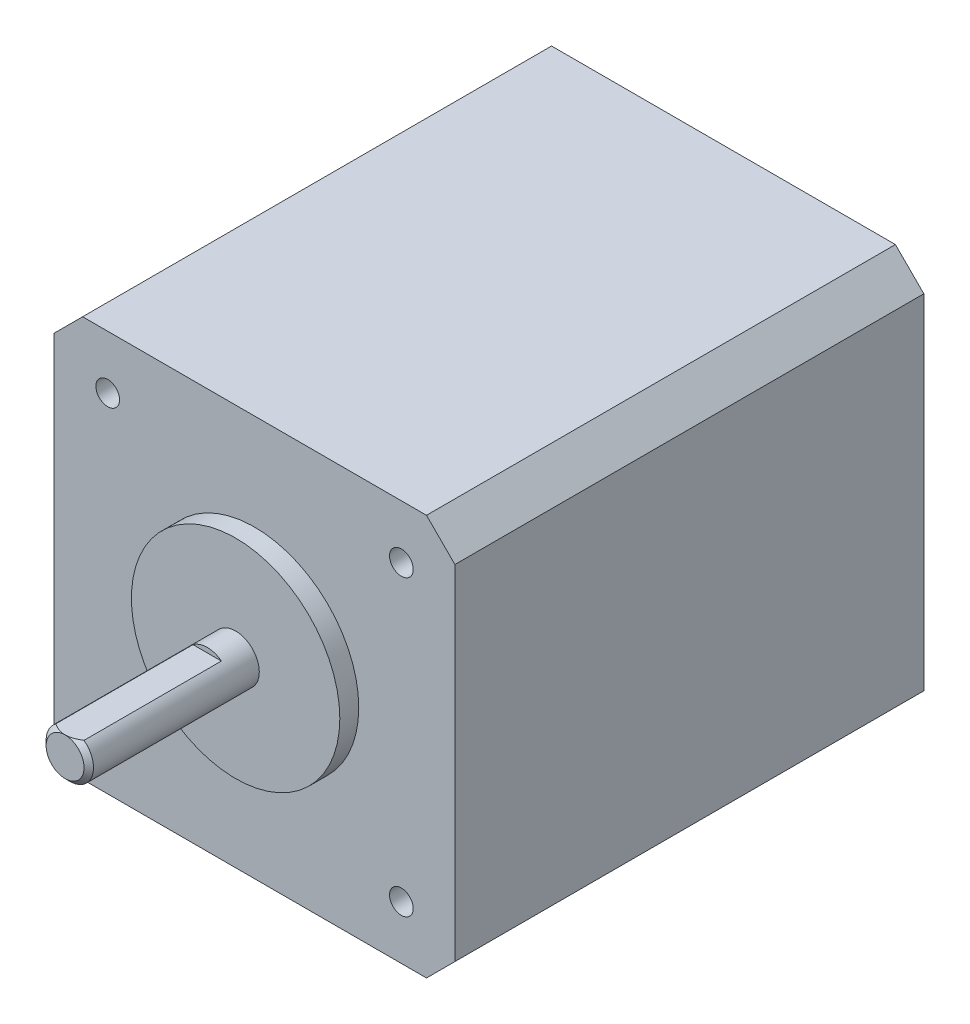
ISO-10303-21;
HEADER;
FILE_DESCRIPTION(('STEP AP214'),'2;1');
FILE_NAME('part.step','',(''),(''),'','','');
FILE_SCHEMA(('AUTOMOTIVE_DESIGN { 1 0 10303 214 1 1 1 1 }'));
ENDSEC;
DATA;
#1=APPLICATION_CONTEXT('core data for automotive mechanical design processes');
#2=APPLICATION_PROTOCOL_DEFINITION('international standard','automotive_design',2000,#1);
#3=PRODUCT_CONTEXT('',#1,'mechanical');
#4=PRODUCT('Part','Part','',(#3));
#5=PRODUCT_RELATED_PRODUCT_CATEGORY('part','',(#4));
#6=PRODUCT_DEFINITION_FORMATION('','',#4);
#7=PRODUCT_DEFINITION_CONTEXT('part definition',#1,'design');
#8=PRODUCT_DEFINITION('design','',#6,#7);
#9=PRODUCT_DEFINITION_SHAPE('','',#8);
#10=(LENGTH_UNIT() NAMED_UNIT(*) SI_UNIT(.MILLI.,.METRE.));
#11=(NAMED_UNIT(*) PLANE_ANGLE_UNIT() SI_UNIT($,.RADIAN.));
#12=(NAMED_UNIT(*) SI_UNIT($,.STERADIAN.) SOLID_ANGLE_UNIT());
#13=UNCERTAINTY_MEASURE_WITH_UNIT(LENGTH_MEASURE(1.E-05),#10,'distance_accuracy_value','');
#14=(GEOMETRIC_REPRESENTATION_CONTEXT(3) GLOBAL_UNCERTAINTY_ASSIGNED_CONTEXT((#13)) GLOBAL_UNIT_ASSIGNED_CONTEXT((#10,
#11,#12)) REPRESENTATION_CONTEXT('',''));
#15=CARTESIAN_POINT('',(0.,0.,0.));
#16=DIRECTION('',(0.,0.,1.));
#17=DIRECTION('',(1.,0.,0.));
#18=AXIS2_PLACEMENT_3D('',#15,#16,#17);
#19=CARTESIAN_POINT('',(0.,0.,0.));
#20=DIRECTION('',(0.,0.,1.));
#21=DIRECTION('',(1.,0.,0.));
#22=AXIS2_PLACEMENT_3D('',#19,#20,#21);
#23=PLANE('',#22);
#24=CARTESIAN_POINT('',(0.,0.,0.));
#25=DIRECTION('',(0.,0.,1.));
#26=DIRECTION('',(1.,0.,0.));
#27=AXIS2_PLACEMENT_3D('',#24,#25,#26);
#28=CIRCLE('',#27,11.);
#29=CARTESIAN_POINT('',(11.,0.,0.));
#30=VERTEX_POINT('',#29);
#31=EDGE_CURVE('E230',#30,#30,#28,.T.);
#32=ORIENTED_EDGE('',*,*,#31,.T.);
#33=EDGE_LOOP('',(#32));
#34=FACE_BOUND('',#33,.T.);
#35=CARTESIAN_POINT('',(0.,0.,0.));
#36=DIRECTION('',(0.,0.,1.));
#37=DIRECTION('',(1.,0.,0.));
#38=AXIS2_PLACEMENT_3D('',#35,#36,#37);
#39=CIRCLE('',#38,2.5);
#40=CARTESIAN_POINT('',(2.5,0.,0.));
#41=VERTEX_POINT('',#40);
#42=EDGE_CURVE('E227',#41,#41,#39,.T.);
#43=ORIENTED_EDGE('',*,*,#42,.F.);
#44=EDGE_LOOP('',(#43));
#45=FACE_BOUND('',#44,.T.);
#46=ADVANCED_FACE('F37',(#34,#45),#23,.T.);
#47=CARTESIAN_POINT('',(0.,0.,-2.));
#48=DIRECTION('',(0.,0.,1.));
#49=DIRECTION('',(1.,0.,0.));
#50=AXIS2_PLACEMENT_3D('',#47,#48,#49);
#51=CYLINDRICAL_SURFACE('',#50,11.);
#52=CARTESIAN_POINT('',(0.,0.,-2.));
#53=DIRECTION('',(0.,0.,1.));
#54=DIRECTION('',(1.,0.,0.));
#55=AXIS2_PLACEMENT_3D('',#52,#53,#54);
#56=CIRCLE('',#55,11.);
#57=CARTESIAN_POINT('',(11.,0.,-2.));
#58=VERTEX_POINT('',#57);
#59=EDGE_CURVE('E217',#58,#58,#56,.F.);
#60=ORIENTED_EDGE('',*,*,#59,.F.);
#61=EDGE_LOOP('',(#60));
#62=FACE_BOUND('',#61,.T.);
#63=ORIENTED_EDGE('',*,*,#31,.F.);
#64=EDGE_LOOP('',(#63));
#65=FACE_BOUND('',#64,.T.);
#66=ADVANCED_FACE('F262',(#62,#65),#51,.T.);
#67=CARTESIAN_POINT('',(0.,0.,18.));
#68=DIRECTION('',(0.,0.,-1.));
#69=DIRECTION('',(-1.,0.,0.));
#70=AXIS2_PLACEMENT_3D('',#67,#68,#69);
#71=CYLINDRICAL_SURFACE('',#70,2.5);
#72=DIRECTION('',(0.,0.,-1.));
#73=VECTOR('',#72,1.);
#74=CARTESIAN_POINT('',(1.5,2.,18.));
#75=LINE('',#74,#73);
#76=CARTESIAN_POINT('',(1.5,2.,3.));
#77=VERTEX_POINT('',#76);
#78=CARTESIAN_POINT('',(1.5,2.,17.5));
#79=VERTEX_POINT('',#78);
#80=EDGE_CURVE('E223',#77,#79,#75,.F.);
#81=ORIENTED_EDGE('',*,*,#80,.T.);
#82=CARTESIAN_POINT('',(0.,0.,17.5));
#83=DIRECTION('',(0.,0.,1.));
#84=DIRECTION('',(1.,0.,0.));
#85=AXIS2_PLACEMENT_3D('',#82,#83,#84);
#86=CIRCLE('',#85,2.5);
#87=CARTESIAN_POINT('',(-1.5,2.,17.5));
#88=VERTEX_POINT('',#87);
#89=EDGE_CURVE('E11',#79,#88,#86,.F.);
#90=ORIENTED_EDGE('',*,*,#89,.T.);
#91=DIRECTION('',(0.,0.,-1.));
#92=VECTOR('',#91,1.);
#93=CARTESIAN_POINT('',(-1.5,2.,18.));
#94=LINE('',#93,#92);
#95=CARTESIAN_POINT('',(-1.5,2.,3.));
#96=VERTEX_POINT('',#95);
#97=EDGE_CURVE('E225',#88,#96,#94,.T.);
#98=ORIENTED_EDGE('',*,*,#97,.T.);
#99=CARTESIAN_POINT('',(0.,0.,3.));
#100=DIRECTION('',(0.,0.,1.));
#101=DIRECTION('',(1.,0.,0.));
#102=AXIS2_PLACEMENT_3D('',#99,#100,#101);
#103=CIRCLE('',#102,2.5);
#104=EDGE_CURVE('E233',#77,#96,#103,.T.);
#105=ORIENTED_EDGE('',*,*,#104,.F.);
#106=EDGE_LOOP('',(#81,#90,#98,#105));
#107=FACE_BOUND('',#106,.T.);
#108=ORIENTED_EDGE('',*,*,#42,.T.);
#109=EDGE_LOOP('',(#108));
#110=FACE_BOUND('',#109,.T.);
#111=ADVANCED_FACE('F258',(#107,#110),#71,.T.);
#112=CARTESIAN_POINT('',(0.,0.,18.));
#113=DIRECTION('',(0.,0.,1.));
#114=DIRECTION('',(1.,0.,0.));
#115=AXIS2_PLACEMENT_3D('',#112,#113,#114);
#116=PLANE('',#115);
#117=CARTESIAN_POINT('',(0.,0.,18.));
#118=DIRECTION('',(0.,0.,1.));
#119=DIRECTION('',(1.,0.,0.));
#120=AXIS2_PLACEMENT_3D('',#117,#118,#119);
#121=CIRCLE('',#120,2.00000000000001);
#122=CARTESIAN_POINT('',(0.,2.,18.));
#123=VERTEX_POINT('',#122);
#124=EDGE_CURVE('E236',#123,#123,#121,.T.);
#125=ORIENTED_EDGE('',*,*,#124,.T.);
#126=EDGE_LOOP('',(#125));
#127=FACE_BOUND('',#126,.T.);
#128=ADVANCED_FACE('F254',(#127),#116,.T.);
#129=CARTESIAN_POINT('',(0.,0.,3.));
#130=DIRECTION('',(0.,0.,1.));
#131=DIRECTION('',(1.,0.,0.));
#132=AXIS2_PLACEMENT_3D('',#129,#130,#131);
#133=PLANE('',#132);
#134=ORIENTED_EDGE('',*,*,#104,.T.);
#135=DIRECTION('',(1.,0.,0.));
#136=VECTOR('',#135,1.);
#137=CARTESIAN_POINT('',(-2.5,2.,3.));
#138=LINE('',#137,#136);
#139=EDGE_CURVE('E220',#96,#77,#138,.T.);
#140=ORIENTED_EDGE('',*,*,#139,.T.);
#141=EDGE_LOOP('',(#134,#140));
#142=FACE_BOUND('',#141,.T.);
#143=ADVANCED_FACE('F252',(#142),#133,.T.);
#144=CARTESIAN_POINT('',(0.,2.,3.));
#145=DIRECTION('',(0.,-1.,0.));
#146=DIRECTION('',(0.,0.,-1.));
#147=AXIS2_PLACEMENT_3D('',#144,#145,#146);
#148=PLANE('',#147);
#149=CARTESIAN_POINT('',(-1.5,2.,17.5));
#150=CARTESIAN_POINT('',(-1.42763018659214,2.,17.5433736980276));
#151=CARTESIAN_POINT('',(-1.35436226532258,2.,17.5853687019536));
#152=CARTESIAN_POINT('',(-1.20549660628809,2.,17.6656443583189));
#153=CARTESIAN_POINT('',(-1.12989157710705,2.,17.7039114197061));
#154=CARTESIAN_POINT('',(-0.978296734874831,2.,17.774534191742));
#155=CARTESIAN_POINT('',(-0.902366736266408,2.,17.8070165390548));
#156=CARTESIAN_POINT('',(-0.748220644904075,2.,17.8658090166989));
#157=CARTESIAN_POINT('',(-0.670007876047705,2.,17.8921276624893));
#158=CARTESIAN_POINT('',(-0.543060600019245,2.,17.9280861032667));
#159=CARTESIAN_POINT('',(-0.495021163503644,2.,17.9401901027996));
#160=CARTESIAN_POINT('',(-0.398260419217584,2.,17.9612794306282));
#161=CARTESIAN_POINT('',(-0.349539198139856,2.,17.9702651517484));
#162=CARTESIAN_POINT('',(-0.250852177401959,2.,17.984927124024));
#163=CARTESIAN_POINT('',(-0.20087865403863,2.,17.9905520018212));
#164=CARTESIAN_POINT('',(-0.100607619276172,2.,17.9981023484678));
#165=CARTESIAN_POINT('',(-0.0503098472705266,2.,18.0000243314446));
#166=CARTESIAN_POINT('',(0.,2.,18.));
#167=B_SPLINE_CURVE_WITH_KNOTS('',3,(#149,#150,#151,#152,#153,#154,#155,#156,#157,#158,#159,
#160,#161,#162,#163,#164,#165,#166),.UNSPECIFIED.,.F.,.F.,(4,2,2,2,2,2,2,2,4),(0.,
0.253195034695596,0.507281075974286,0.754837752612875,1.00205037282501,1.15058504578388,
1.29910100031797,1.44983263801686,1.600706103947),.UNSPECIFIED.);
#168=EDGE_CURVE('E239',#88,#123,#167,.T.);
#169=ORIENTED_EDGE('',*,*,#168,.T.);
#170=CARTESIAN_POINT('',(0.,2.00000000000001,18.));
#171=CARTESIAN_POINT('',(0.0614966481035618,2.,18.0000514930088));
#172=CARTESIAN_POINT('',(0.122961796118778,2.,17.997164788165));
#173=CARTESIAN_POINT('',(0.245274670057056,2.,17.9859212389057));
#174=CARTESIAN_POINT('',(0.306123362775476,2.,17.9775750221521));
#175=CARTESIAN_POINT('',(0.425885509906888,2.,17.9559969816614));
#176=CARTESIAN_POINT('',(0.484814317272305,2.,17.9428488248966));
#177=CARTESIAN_POINT('',(0.601555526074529,2.,17.9122507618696));
#178=CARTESIAN_POINT('',(0.659367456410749,2.,17.8947990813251));
#179=CARTESIAN_POINT('',(0.784576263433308,2.,17.8525702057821));
#180=CARTESIAN_POINT('',(0.851714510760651,2.,17.8270315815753));
#181=CARTESIAN_POINT('',(0.984250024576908,2.,17.7717452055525));
#182=CARTESIAN_POINT('',(1.04964642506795,2.,17.7419954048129));
#183=CARTESIAN_POINT('',(1.18016546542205,2.,17.6784785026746));
#184=CARTESIAN_POINT('',(1.24525271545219,2.,17.6446394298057));
#185=CARTESIAN_POINT('',(1.37378197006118,2.,17.5742160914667));
#186=CARTESIAN_POINT('',(1.43722666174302,2.,17.5376367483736));
#187=CARTESIAN_POINT('',(1.5,2.,17.5));
#188=B_SPLINE_CURVE_WITH_KNOTS('',3,(#170,#171,#172,#173,#174,#175,#176,#177,#178,#179,#180,
#181,#182,#183,#184,#185,#186,#187),.UNSPECIFIED.,.F.,.F.,(4,2,2,2,2,2,2,2,4),(0.,
0.184371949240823,0.368386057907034,0.549336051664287,0.730360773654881,0.945674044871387,
1.16109243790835,1.38109142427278,1.60070428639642),.UNSPECIFIED.);
#189=EDGE_CURVE('E46',#123,#79,#188,.T.);
#190=ORIENTED_EDGE('',*,*,#189,.T.);
#191=ORIENTED_EDGE('',*,*,#80,.F.);
#192=ORIENTED_EDGE('',*,*,#139,.F.);
#193=ORIENTED_EDGE('',*,*,#97,.F.);
#194=EDGE_LOOP('',(#169,#190,#191,#192,#193));
#195=FACE_BOUND('',#194,.T.);
#196=ADVANCED_FACE('F247',(#195),#148,.F.);
#197=CARTESIAN_POINT('',(0.,0.,18.));
#198=DIRECTION('',(0.,0.,-1.));
#199=DIRECTION('',(-1.,0.,0.));
#200=AXIS2_PLACEMENT_3D('',#197,#198,#199);
#201=CONICAL_SURFACE('',#200,2.00000000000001,0.785398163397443);
#202=ORIENTED_EDGE('',*,*,#168,.F.);
#203=ORIENTED_EDGE('',*,*,#89,.F.);
#204=ORIENTED_EDGE('',*,*,#189,.F.);
#205=ORIENTED_EDGE('',*,*,#124,.F.);
#206=EDGE_LOOP('',(#202,#203,#204,#205));
#207=FACE_BOUND('',#206,.T.);
#208=ADVANCED_FACE('F39',(#207),#201,.T.);
#209=CARTESIAN_POINT('',(21.15,-18.15,-51.5));
#210=DIRECTION('',(-1.,0.,0.));
#211=DIRECTION('',(0.,0.,1.));
#212=AXIS2_PLACEMENT_3D('',#209,#210,#211);
#213=PLANE('',#212);
#214=DIRECTION('',(0.,-1.,0.));
#215=VECTOR('',#214,1.);
#216=CARTESIAN_POINT('',(21.15,-18.15,-2.));
#217=LINE('',#216,#215);
#218=CARTESIAN_POINT('',(21.15,18.15,-2.));
#219=VERTEX_POINT('',#218);
#220=CARTESIAN_POINT('',(21.15,-18.15,-2.));
#221=VERTEX_POINT('',#220);
#222=EDGE_CURVE('E158',#219,#221,#217,.T.);
#223=ORIENTED_EDGE('',*,*,#222,.T.);
#224=DIRECTION('',(0.,0.,1.));
#225=VECTOR('',#224,1.);
#226=CARTESIAN_POINT('',(21.15,-18.15,-51.5));
#227=LINE('',#226,#225);
#228=CARTESIAN_POINT('',(21.15,-18.15,-51.5));
#229=VERTEX_POINT('',#228);
#230=EDGE_CURVE('E214',#229,#221,#227,.T.);
#231=ORIENTED_EDGE('',*,*,#230,.F.);
#232=DIRECTION('',(0.,-1.,0.));
#233=VECTOR('',#232,1.);
#234=CARTESIAN_POINT('',(21.15,-18.15,-51.5));
#235=LINE('',#234,#233);
#236=CARTESIAN_POINT('',(21.15,18.15,-51.5));
#237=VERTEX_POINT('',#236);
#238=EDGE_CURVE('E159',#237,#229,#235,.T.);
#239=ORIENTED_EDGE('',*,*,#238,.F.);
#240=DIRECTION('',(0.,0.,1.));
#241=VECTOR('',#240,1.);
#242=CARTESIAN_POINT('',(21.15,18.15,-51.5));
#243=LINE('',#242,#241);
#244=EDGE_CURVE('E177',#237,#219,#243,.T.);
#245=ORIENTED_EDGE('',*,*,#244,.T.);
#246=EDGE_LOOP('',(#223,#231,#239,#245));
#247=FACE_BOUND('',#246,.T.);
#248=ADVANCED_FACE('F288',(#247),#213,.F.);
#249=CARTESIAN_POINT('',(18.15,-21.15,-51.5));
#250=DIRECTION('',(-0.707106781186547,0.707106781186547,0.));
#251=DIRECTION('',(-0.707106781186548,-0.707106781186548,0.));
#252=AXIS2_PLACEMENT_3D('',#249,#250,#251);
#253=PLANE('',#252);
#254=DIRECTION('',(-0.707106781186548,-0.707106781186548,0.));
#255=VECTOR('',#254,1.);
#256=CARTESIAN_POINT('',(18.15,-21.15,-2.));
#257=LINE('',#256,#255);
#258=CARTESIAN_POINT('',(18.15,-21.15,-2.));
#259=VERTEX_POINT('',#258);
#260=EDGE_CURVE('E180',#221,#259,#257,.T.);
#261=ORIENTED_EDGE('',*,*,#260,.T.);
#262=DIRECTION('',(0.,0.,1.));
#263=VECTOR('',#262,1.);
#264=CARTESIAN_POINT('',(18.15,-21.15,-51.5));
#265=LINE('',#264,#263);
#266=CARTESIAN_POINT('',(18.15,-21.15,-51.5));
#267=VERTEX_POINT('',#266);
#268=EDGE_CURVE('E211',#267,#259,#265,.T.);
#269=ORIENTED_EDGE('',*,*,#268,.F.);
#270=DIRECTION('',(-0.707106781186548,-0.707106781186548,0.));
#271=VECTOR('',#270,1.);
#272=CARTESIAN_POINT('',(18.15,-21.15,-51.5));
#273=LINE('',#272,#271);
#274=EDGE_CURVE('E162',#229,#267,#273,.T.);
#275=ORIENTED_EDGE('',*,*,#274,.F.);
#276=ORIENTED_EDGE('',*,*,#230,.T.);
#277=EDGE_LOOP('',(#261,#269,#275,#276));
#278=FACE_BOUND('',#277,.T.);
#279=ADVANCED_FACE('F319',(#278),#253,.F.);
#280=CARTESIAN_POINT('',(-18.15,-21.15,-51.5));
#281=DIRECTION('',(0.,1.,0.));
#282=DIRECTION('',(-1.,0.,0.));
#283=AXIS2_PLACEMENT_3D('',#280,#281,#282);
#284=PLANE('',#283);
#285=DIRECTION('',(-1.,0.,0.));
#286=VECTOR('',#285,1.);
#287=CARTESIAN_POINT('',(-18.15,-21.15,-2.));
#288=LINE('',#287,#286);
#289=CARTESIAN_POINT('',(-18.15,-21.15,-2.));
#290=VERTEX_POINT('',#289);
#291=EDGE_CURVE('E182',#259,#290,#288,.T.);
#292=ORIENTED_EDGE('',*,*,#291,.T.);
#293=DIRECTION('',(0.,0.,1.));
#294=VECTOR('',#293,1.);
#295=CARTESIAN_POINT('',(-18.15,-21.15,-51.5));
#296=LINE('',#295,#294);
#297=CARTESIAN_POINT('',(-18.15,-21.15,-51.5));
#298=VERTEX_POINT('',#297);
#299=EDGE_CURVE('E208',#298,#290,#296,.T.);
#300=ORIENTED_EDGE('',*,*,#299,.F.);
#301=DIRECTION('',(-1.,0.,0.));
#302=VECTOR('',#301,1.);
#303=CARTESIAN_POINT('',(-18.15,-21.15,-51.5));
#304=LINE('',#303,#302);
#305=EDGE_CURVE('E165',#267,#298,#304,.T.);
#306=ORIENTED_EDGE('',*,*,#305,.F.);
#307=ORIENTED_EDGE('',*,*,#268,.T.);
#308=EDGE_LOOP('',(#292,#300,#306,#307));
#309=FACE_BOUND('',#308,.T.);
#310=ADVANCED_FACE('F316',(#309),#284,.F.);
#311=CARTESIAN_POINT('',(-21.15,-18.15,-51.5));
#312=DIRECTION('',(0.707106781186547,0.707106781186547,0.));
#313=DIRECTION('',(-0.707106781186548,0.707106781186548,0.));
#314=AXIS2_PLACEMENT_3D('',#311,#312,#313);
#315=PLANE('',#314);
#316=DIRECTION('',(-0.707106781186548,0.707106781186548,0.));
#317=VECTOR('',#316,1.);
#318=CARTESIAN_POINT('',(-21.15,-18.15,-2.));
#319=LINE('',#318,#317);
#320=CARTESIAN_POINT('',(-21.15,-18.15,-2.));
#321=VERTEX_POINT('',#320);
#322=EDGE_CURVE('E184',#290,#321,#319,.T.);
#323=ORIENTED_EDGE('',*,*,#322,.T.);
#324=DIRECTION('',(0.,0.,1.));
#325=VECTOR('',#324,1.);
#326=CARTESIAN_POINT('',(-21.15,-18.15,-51.5));
#327=LINE('',#326,#325);
#328=CARTESIAN_POINT('',(-21.15,-18.15,-51.5));
#329=VERTEX_POINT('',#328);
#330=EDGE_CURVE('E205',#329,#321,#327,.T.);
#331=ORIENTED_EDGE('',*,*,#330,.F.);
#332=DIRECTION('',(-0.707106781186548,0.707106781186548,0.));
#333=VECTOR('',#332,1.);
#334=CARTESIAN_POINT('',(-21.15,-18.15,-51.5));
#335=LINE('',#334,#333);
#336=EDGE_CURVE('E167',#298,#329,#335,.T.);
#337=ORIENTED_EDGE('',*,*,#336,.F.);
#338=ORIENTED_EDGE('',*,*,#299,.T.);
#339=EDGE_LOOP('',(#323,#331,#337,#338));
#340=FACE_BOUND('',#339,.T.);
#341=ADVANCED_FACE('F311',(#340),#315,.F.);
#342=CARTESIAN_POINT('',(-21.15,18.15,-51.5));
#343=DIRECTION('',(1.,0.,0.));
#344=DIRECTION('',(0.,1.,0.));
#345=AXIS2_PLACEMENT_3D('',#342,#343,#344);
#346=PLANE('',#345);
#347=DIRECTION('',(0.,1.,0.));
#348=VECTOR('',#347,1.);
#349=CARTESIAN_POINT('',(-21.15,18.15,-2.));
#350=LINE('',#349,#348);
#351=CARTESIAN_POINT('',(-21.15,18.15,-2.));
#352=VERTEX_POINT('',#351);
#353=EDGE_CURVE('E186',#321,#352,#350,.T.);
#354=ORIENTED_EDGE('',*,*,#353,.T.);
#355=DIRECTION('',(0.,0.,1.));
#356=VECTOR('',#355,1.);
#357=CARTESIAN_POINT('',(-21.15,18.15,-51.5));
#358=LINE('',#357,#356);
#359=CARTESIAN_POINT('',(-21.15,18.15,-51.5));
#360=VERTEX_POINT('',#359);
#361=EDGE_CURVE('E202',#360,#352,#358,.T.);
#362=ORIENTED_EDGE('',*,*,#361,.F.);
#363=DIRECTION('',(0.,1.,0.));
#364=VECTOR('',#363,1.);
#365=CARTESIAN_POINT('',(-21.15,18.15,-51.5));
#366=LINE('',#365,#364);
#367=EDGE_CURVE('E169',#329,#360,#366,.T.);
#368=ORIENTED_EDGE('',*,*,#367,.F.);
#369=ORIENTED_EDGE('',*,*,#330,.T.);
#370=EDGE_LOOP('',(#354,#362,#368,#369));
#371=FACE_BOUND('',#370,.T.);
#372=ADVANCED_FACE('F307',(#371),#346,.F.);
#373=CARTESIAN_POINT('',(-18.15,21.15,-51.5));
#374=DIRECTION('',(0.707106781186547,-0.707106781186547,0.));
#375=DIRECTION('',(0.707106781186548,0.707106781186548,0.));
#376=AXIS2_PLACEMENT_3D('',#373,#374,#375);
#377=PLANE('',#376);
#378=DIRECTION('',(0.707106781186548,0.707106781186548,0.));
#379=VECTOR('',#378,1.);
#380=CARTESIAN_POINT('',(-18.15,21.15,-2.));
#381=LINE('',#380,#379);
#382=CARTESIAN_POINT('',(-18.15,21.15,-2.));
#383=VERTEX_POINT('',#382);
#384=EDGE_CURVE('E188',#352,#383,#381,.T.);
#385=ORIENTED_EDGE('',*,*,#384,.T.);
#386=DIRECTION('',(0.,0.,1.));
#387=VECTOR('',#386,1.);
#388=CARTESIAN_POINT('',(-18.15,21.15,-51.5));
#389=LINE('',#388,#387);
#390=CARTESIAN_POINT('',(-18.15,21.15,-51.5));
#391=VERTEX_POINT('',#390);
#392=EDGE_CURVE('E199',#391,#383,#389,.T.);
#393=ORIENTED_EDGE('',*,*,#392,.F.);
#394=DIRECTION('',(0.707106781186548,0.707106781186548,0.));
#395=VECTOR('',#394,1.);
#396=CARTESIAN_POINT('',(-18.15,21.15,-51.5));
#397=LINE('',#396,#395);
#398=EDGE_CURVE('E171',#360,#391,#397,.T.);
#399=ORIENTED_EDGE('',*,*,#398,.F.);
#400=ORIENTED_EDGE('',*,*,#361,.T.);
#401=EDGE_LOOP('',(#385,#393,#399,#400));
#402=FACE_BOUND('',#401,.T.);
#403=ADVANCED_FACE('F302',(#402),#377,.F.);
#404=CARTESIAN_POINT('',(18.15,21.15,-51.5));
#405=DIRECTION('',(0.,-1.,0.));
#406=DIRECTION('',(0.,0.,-1.));
#407=AXIS2_PLACEMENT_3D('',#404,#405,#406);
#408=PLANE('',#407);
#409=DIRECTION('',(1.,0.,0.));
#410=VECTOR('',#409,1.);
#411=CARTESIAN_POINT('',(18.15,21.15,-2.));
#412=LINE('',#411,#410);
#413=CARTESIAN_POINT('',(18.15,21.15,-2.));
#414=VERTEX_POINT('',#413);
#415=EDGE_CURVE('E191',#383,#414,#412,.T.);
#416=ORIENTED_EDGE('',*,*,#415,.T.);
#417=DIRECTION('',(0.,0.,1.));
#418=VECTOR('',#417,1.);
#419=CARTESIAN_POINT('',(18.15,21.15,-51.5));
#420=LINE('',#419,#418);
#421=CARTESIAN_POINT('',(18.15,21.15,-51.5));
#422=VERTEX_POINT('',#421);
#423=EDGE_CURVE('E196',#422,#414,#420,.T.);
#424=ORIENTED_EDGE('',*,*,#423,.F.);
#425=DIRECTION('',(1.,0.,0.));
#426=VECTOR('',#425,1.);
#427=CARTESIAN_POINT('',(0.,21.15,-51.5));
#428=LINE('',#427,#426);
#429=EDGE_CURVE('E173',#391,#422,#428,.T.);
#430=ORIENTED_EDGE('',*,*,#429,.F.);
#431=ORIENTED_EDGE('',*,*,#392,.T.);
#432=EDGE_LOOP('',(#416,#424,#430,#431));
#433=FACE_BOUND('',#432,.T.);
#434=ADVANCED_FACE('F297',(#433),#408,.F.);
#435=CARTESIAN_POINT('',(21.15,18.15,-51.5));
#436=DIRECTION('',(-0.707106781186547,-0.707106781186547,0.));
#437=DIRECTION('',(0.707106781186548,-0.707106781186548,0.));
#438=AXIS2_PLACEMENT_3D('',#435,#436,#437);
#439=PLANE('',#438);
#440=DIRECTION('',(0.707106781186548,-0.707106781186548,0.));
#441=VECTOR('',#440,1.);
#442=CARTESIAN_POINT('',(21.15,18.15,-2.));
#443=LINE('',#442,#441);
#444=EDGE_CURVE('E163',#414,#219,#443,.T.);
#445=ORIENTED_EDGE('',*,*,#444,.T.);
#446=ORIENTED_EDGE('',*,*,#244,.F.);
#447=DIRECTION('',(0.707106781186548,-0.707106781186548,0.));
#448=VECTOR('',#447,1.);
#449=CARTESIAN_POINT('',(21.15,18.15,-51.5));
#450=LINE('',#449,#448);
#451=EDGE_CURVE('E175',#422,#237,#450,.T.);
#452=ORIENTED_EDGE('',*,*,#451,.F.);
#453=ORIENTED_EDGE('',*,*,#423,.T.);
#454=EDGE_LOOP('',(#445,#446,#452,#453));
#455=FACE_BOUND('',#454,.T.);
#456=ADVANCED_FACE('F293',(#455),#439,.F.);
#457=CARTESIAN_POINT('',(0.,0.,-51.5));
#458=DIRECTION('',(0.,0.,1.));
#459=DIRECTION('',(1.,0.,0.));
#460=AXIS2_PLACEMENT_3D('',#457,#458,#459);
#461=PLANE('',#460);
#462=ORIENTED_EDGE('',*,*,#238,.T.);
#463=ORIENTED_EDGE('',*,*,#274,.T.);
#464=ORIENTED_EDGE('',*,*,#305,.T.);
#465=ORIENTED_EDGE('',*,*,#336,.T.);
#466=ORIENTED_EDGE('',*,*,#367,.T.);
#467=ORIENTED_EDGE('',*,*,#398,.T.);
#468=ORIENTED_EDGE('',*,*,#429,.T.);
#469=ORIENTED_EDGE('',*,*,#451,.T.);
#470=EDGE_LOOP('',(#462,#463,#464,#465,#466,#467,#468,#469));
#471=FACE_BOUND('',#470,.T.);
#472=ADVANCED_FACE('F280',(#471),#461,.F.);
#473=CARTESIAN_POINT('',(0.,0.,-2.));
#474=DIRECTION('',(0.,0.,1.));
#475=DIRECTION('',(1.,0.,0.));
#476=AXIS2_PLACEMENT_3D('',#473,#474,#475);
#477=PLANE('',#476);
#478=CARTESIAN_POINT('',(-15.5,15.5,-2.));
#479=DIRECTION('',(0.,0.,1.));
#480=DIRECTION('',(1.,0.,0.));
#481=AXIS2_PLACEMENT_3D('',#478,#479,#480);
#482=CIRCLE('',#481,1.24999999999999);
#483=CARTESIAN_POINT('',(-14.25,15.5,-2.));
#484=VERTEX_POINT('',#483);
#485=EDGE_CURVE('E136',#484,#484,#482,.T.);
#486=ORIENTED_EDGE('',*,*,#485,.F.);
#487=EDGE_LOOP('',(#486));
#488=FACE_BOUND('',#487,.T.);
#489=CARTESIAN_POINT('',(15.5,15.5,-2.));
#490=DIRECTION('',(0.,0.,1.));
#491=DIRECTION('',(1.,0.,0.));
#492=AXIS2_PLACEMENT_3D('',#489,#490,#491);
#493=CIRCLE('',#492,1.24999999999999);
#494=CARTESIAN_POINT('',(16.75,15.5,-2.));
#495=VERTEX_POINT('',#494);
#496=EDGE_CURVE('E135',#495,#495,#493,.T.);
#497=ORIENTED_EDGE('',*,*,#496,.F.);
#498=EDGE_LOOP('',(#497));
#499=FACE_BOUND('',#498,.T.);
#500=CARTESIAN_POINT('',(15.5,-15.5,-2.));
#501=DIRECTION('',(0.,0.,1.));
#502=DIRECTION('',(1.,0.,0.));
#503=AXIS2_PLACEMENT_3D('',#500,#501,#502);
#504=CIRCLE('',#503,1.24999999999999);
#505=CARTESIAN_POINT('',(16.75,-15.5,-2.));
#506=VERTEX_POINT('',#505);
#507=EDGE_CURVE('E146',#506,#506,#504,.T.);
#508=ORIENTED_EDGE('',*,*,#507,.F.);
#509=EDGE_LOOP('',(#508));
#510=FACE_BOUND('',#509,.T.);
#511=CARTESIAN_POINT('',(-15.5,-15.5,-2.));
#512=DIRECTION('',(0.,0.,1.));
#513=DIRECTION('',(1.,0.,0.));
#514=AXIS2_PLACEMENT_3D('',#511,#512,#513);
#515=CIRCLE('',#514,1.24999999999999);
#516=CARTESIAN_POINT('',(-14.25,-15.5,-2.));
#517=VERTEX_POINT('',#516);
#518=EDGE_CURVE('E152',#517,#517,#515,.T.);
#519=ORIENTED_EDGE('',*,*,#518,.F.);
#520=EDGE_LOOP('',(#519));
#521=FACE_BOUND('',#520,.T.);
#522=ORIENTED_EDGE('',*,*,#59,.T.);
#523=EDGE_LOOP('',(#522));
#524=FACE_BOUND('',#523,.T.);
#525=ORIENTED_EDGE('',*,*,#222,.F.);
#526=ORIENTED_EDGE('',*,*,#444,.F.);
#527=ORIENTED_EDGE('',*,*,#415,.F.);
#528=ORIENTED_EDGE('',*,*,#384,.F.);
#529=ORIENTED_EDGE('',*,*,#353,.F.);
#530=ORIENTED_EDGE('',*,*,#322,.F.);
#531=ORIENTED_EDGE('',*,*,#291,.F.);
#532=ORIENTED_EDGE('',*,*,#260,.F.);
#533=EDGE_LOOP('',(#525,#526,#527,#528,#529,#530,#531,#532));
#534=FACE_BOUND('',#533,.T.);
#535=ADVANCED_FACE('F276',(#488,#499,#510,#521,#524,#534),#477,.T.);
#536=CARTESIAN_POINT('',(-15.5,-15.5,-9.));
#537=DIRECTION('',(0.,0.,1.));
#538=DIRECTION('',(1.,0.,0.));
#539=AXIS2_PLACEMENT_3D('',#536,#537,#538);
#540=CONICAL_SURFACE('',#539,1.25,1.02974425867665);
#541=CARTESIAN_POINT('',(-15.5,-15.5,-9.75107577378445));
#542=VERTEX_POINT('',#541);
#543=VERTEX_LOOP('',#542);
#544=FACE_BOUND('',#543,.T.);
#545=CARTESIAN_POINT('',(-15.5,-15.5,-9.));
#546=DIRECTION('',(0.,0.,1.));
#547=DIRECTION('',(1.,0.,0.));
#548=AXIS2_PLACEMENT_3D('',#545,#546,#547);
#549=CIRCLE('',#548,1.25);
#550=CARTESIAN_POINT('',(-14.25,-15.5,-9.));
#551=VERTEX_POINT('',#550);
#552=EDGE_CURVE('E155',#551,#551,#549,.T.);
#553=ORIENTED_EDGE('',*,*,#552,.T.);
#554=EDGE_LOOP('',(#553));
#555=FACE_BOUND('',#554,.T.);
#556=ADVANCED_FACE('F279',(#544,#555),#540,.F.);
#557=CARTESIAN_POINT('',(-15.5,-15.5,-2.));
#558=DIRECTION('',(0.,0.,1.));
#559=DIRECTION('',(1.,0.,0.));
#560=AXIS2_PLACEMENT_3D('',#557,#558,#559);
#561=CYLINDRICAL_SURFACE('',#560,1.24999999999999);
#562=ORIENTED_EDGE('',*,*,#552,.F.);
#563=EDGE_LOOP('',(#562));
#564=FACE_BOUND('',#563,.T.);
#565=ORIENTED_EDGE('',*,*,#518,.T.);
#566=EDGE_LOOP('',(#565));
#567=FACE_BOUND('',#566,.T.);
#568=ADVANCED_FACE('F437',(#564,#567),#561,.F.);
#569=CARTESIAN_POINT('',(15.5,-15.5,-9.));
#570=DIRECTION('',(0.,0.,1.));
#571=DIRECTION('',(1.,0.,0.));
#572=AXIS2_PLACEMENT_3D('',#569,#570,#571);
#573=CONICAL_SURFACE('',#572,1.25,1.02974425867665);
#574=CARTESIAN_POINT('',(15.5,-15.5,-9.75107577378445));
#575=VERTEX_POINT('',#574);
#576=VERTEX_LOOP('',#575);
#577=FACE_BOUND('',#576,.T.);
#578=CARTESIAN_POINT('',(15.5,-15.5,-9.));
#579=DIRECTION('',(0.,0.,1.));
#580=DIRECTION('',(1.,0.,0.));
#581=AXIS2_PLACEMENT_3D('',#578,#579,#580);
#582=CIRCLE('',#581,1.25);
#583=CARTESIAN_POINT('',(16.75,-15.5,-9.));
#584=VERTEX_POINT('',#583);
#585=EDGE_CURVE('E149',#584,#584,#582,.T.);
#586=ORIENTED_EDGE('',*,*,#585,.T.);
#587=EDGE_LOOP('',(#586));
#588=FACE_BOUND('',#587,.T.);
#589=ADVANCED_FACE('F447',(#577,#588),#573,.F.);
#590=CARTESIAN_POINT('',(15.5,-15.5,-2.));
#591=DIRECTION('',(0.,0.,1.));
#592=DIRECTION('',(1.,0.,0.));
#593=AXIS2_PLACEMENT_3D('',#590,#591,#592);
#594=CYLINDRICAL_SURFACE('',#593,1.24999999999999);
#595=ORIENTED_EDGE('',*,*,#585,.F.);
#596=EDGE_LOOP('',(#595));
#597=FACE_BOUND('',#596,.T.);
#598=ORIENTED_EDGE('',*,*,#507,.T.);
#599=EDGE_LOOP('',(#598));
#600=FACE_BOUND('',#599,.T.);
#601=ADVANCED_FACE('F457',(#597,#600),#594,.F.);
#602=CARTESIAN_POINT('',(15.5,15.5,-9.));
#603=DIRECTION('',(0.,0.,1.));
#604=DIRECTION('',(1.,0.,0.));
#605=AXIS2_PLACEMENT_3D('',#602,#603,#604);
#606=CONICAL_SURFACE('',#605,1.25,1.02974425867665);
#607=CARTESIAN_POINT('',(15.5,15.5,-9.75107577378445));
#608=VERTEX_POINT('',#607);
#609=VERTEX_LOOP('',#608);
#610=FACE_BOUND('',#609,.T.);
#611=CARTESIAN_POINT('',(15.5,15.5,-9.));
#612=DIRECTION('',(0.,0.,1.));
#613=DIRECTION('',(1.,0.,0.));
#614=AXIS2_PLACEMENT_3D('',#611,#612,#613);
#615=CIRCLE('',#614,1.25);
#616=CARTESIAN_POINT('',(16.75,15.5,-9.));
#617=VERTEX_POINT('',#616);
#618=EDGE_CURVE('E139',#617,#617,#615,.T.);
#619=ORIENTED_EDGE('',*,*,#618,.T.);
#620=EDGE_LOOP('',(#619));
#621=FACE_BOUND('',#620,.T.);
#622=ADVANCED_FACE('F467',(#610,#621),#606,.F.);
#623=CARTESIAN_POINT('',(15.5,15.5,-2.));
#624=DIRECTION('',(0.,0.,1.));
#625=DIRECTION('',(1.,0.,0.));
#626=AXIS2_PLACEMENT_3D('',#623,#624,#625);
#627=CYLINDRICAL_SURFACE('',#626,1.24999999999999);
#628=ORIENTED_EDGE('',*,*,#618,.F.);
#629=EDGE_LOOP('',(#628));
#630=FACE_BOUND('',#629,.T.);
#631=ORIENTED_EDGE('',*,*,#496,.T.);
#632=EDGE_LOOP('',(#631));
#633=FACE_BOUND('',#632,.T.);
#634=ADVANCED_FACE('F129',(#630,#633),#627,.F.);
#635=CARTESIAN_POINT('',(-15.5,15.5,-9.));
#636=DIRECTION('',(0.,0.,1.));
#637=DIRECTION('',(1.,0.,0.));
#638=AXIS2_PLACEMENT_3D('',#635,#636,#637);
#639=CONICAL_SURFACE('',#638,1.25,1.02974425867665);
#640=CARTESIAN_POINT('',(-15.5,15.5,-9.75107577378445));
#641=VERTEX_POINT('',#640);
#642=VERTEX_LOOP('',#641);
#643=FACE_BOUND('',#642,.T.);
#644=CARTESIAN_POINT('',(-15.5,15.5,-9.));
#645=DIRECTION('',(0.,0.,1.));
#646=DIRECTION('',(1.,0.,0.));
#647=AXIS2_PLACEMENT_3D('',#644,#645,#646);
#648=CIRCLE('',#647,1.25);
#649=CARTESIAN_POINT('',(-14.25,15.5,-9.));
#650=VERTEX_POINT('',#649);
#651=EDGE_CURVE('E133',#650,#650,#648,.T.);
#652=ORIENTED_EDGE('',*,*,#651,.T.);
#653=EDGE_LOOP('',(#652));
#654=FACE_BOUND('',#653,.T.);
#655=ADVANCED_FACE('F125',(#643,#654),#639,.F.);
#656=CARTESIAN_POINT('',(-15.5,15.5,-2.));
#657=DIRECTION('',(0.,0.,1.));
#658=DIRECTION('',(1.,0.,0.));
#659=AXIS2_PLACEMENT_3D('',#656,#657,#658);
#660=CYLINDRICAL_SURFACE('',#659,1.24999999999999);
#661=ORIENTED_EDGE('',*,*,#651,.F.);
#662=EDGE_LOOP('',(#661));
#663=FACE_BOUND('',#662,.T.);
#664=ORIENTED_EDGE('',*,*,#485,.T.);
#665=EDGE_LOOP('',(#664));
#666=FACE_BOUND('',#665,.T.);
#667=ADVANCED_FACE('F128',(#663,#666),#660,.F.);
#668=CLOSED_SHELL('',(#46,#66,#111,#128,#143,#196,#208,#248,#279,#310,#341,#372,#403,#434,#456,
#472,#535,#556,#568,#589,#601,#622,#634,#655,#667));
#669=MANIFOLD_SOLID_BREP('B2',#668);
#670=ADVANCED_BREP_SHAPE_REPRESENTATION('',(#18,#669),#14);
#671=SHAPE_DEFINITION_REPRESENTATION(#9,#670);
ENDSEC;
END-ISO-10303-21;
